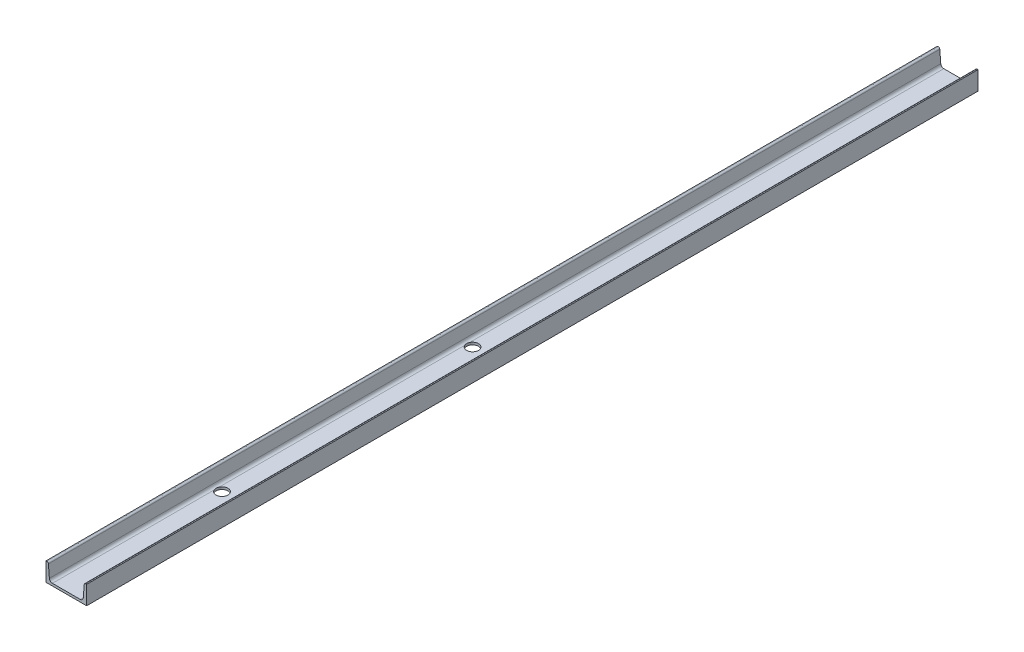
ISO-10303-21;
HEADER;
FILE_DESCRIPTION(('STEP AP214'),'2;1');
FILE_NAME('part.step','',(''),(''),'','','');
FILE_SCHEMA(('AUTOMOTIVE_DESIGN { 1 0 10303 214 1 1 1 1 }'));
ENDSEC;
DATA;
#1=APPLICATION_CONTEXT('core data for automotive mechanical design processes');
#2=APPLICATION_PROTOCOL_DEFINITION('international standard','automotive_design',2000,#1);
#3=PRODUCT_CONTEXT('',#1,'mechanical');
#4=PRODUCT('Part','Part','',(#3));
#5=PRODUCT_RELATED_PRODUCT_CATEGORY('part','',(#4));
#6=PRODUCT_DEFINITION_FORMATION('','',#4);
#7=PRODUCT_DEFINITION_CONTEXT('part definition',#1,'design');
#8=PRODUCT_DEFINITION('design','',#6,#7);
#9=PRODUCT_DEFINITION_SHAPE('','',#8);
#10=(LENGTH_UNIT() NAMED_UNIT(*) SI_UNIT(.MILLI.,.METRE.));
#11=(NAMED_UNIT(*) PLANE_ANGLE_UNIT() SI_UNIT($,.RADIAN.));
#12=(NAMED_UNIT(*) SI_UNIT($,.STERADIAN.) SOLID_ANGLE_UNIT());
#13=UNCERTAINTY_MEASURE_WITH_UNIT(LENGTH_MEASURE(1.E-05),#10,'distance_accuracy_value','');
#14=(GEOMETRIC_REPRESENTATION_CONTEXT(3) GLOBAL_UNCERTAINTY_ASSIGNED_CONTEXT((#13)) GLOBAL_UNIT_ASSIGNED_CONTEXT((#10,
#11,#12)) REPRESENTATION_CONTEXT('',''));
#15=CARTESIAN_POINT('',(0.,0.,0.));
#16=DIRECTION('',(0.,0.,1.));
#17=DIRECTION('',(1.,0.,0.));
#18=AXIS2_PLACEMENT_3D('',#15,#16,#17);
#19=CARTESIAN_POINT('',(41.0512459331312,16.,-1316.5));
#20=DIRECTION('',(0.,0.,1.));
#21=DIRECTION('',(1.,0.,0.));
#22=AXIS2_PLACEMENT_3D('',#19,#20,#21);
#23=CYLINDRICAL_SURFACE('',#22,8.99999999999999);
#24=CARTESIAN_POINT('',(41.0512459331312,16.,1316.5));
#25=DIRECTION('',(0.,0.,-1.));
#26=DIRECTION('',(-1.,0.,0.));
#27=AXIS2_PLACEMENT_3D('',#24,#25,#26);
#28=CIRCLE('',#27,8.99999999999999);
#29=CARTESIAN_POINT('',(50.0225834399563,15.282292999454,1316.5));
#30=VERTEX_POINT('',#29);
#31=CARTESIAN_POINT('',(41.0512459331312,7.,1316.5));
#32=VERTEX_POINT('',#31);
#33=EDGE_CURVE('E266',#30,#32,#28,.T.);
#34=ORIENTED_EDGE('',*,*,#33,.F.);
#35=DIRECTION('',(0.,0.,1.));
#36=VECTOR('',#35,1.);
#37=CARTESIAN_POINT('',(50.0225834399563,15.282292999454,-1316.5));
#38=LINE('',#37,#36);
#39=CARTESIAN_POINT('',(50.0225834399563,15.282292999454,-1316.5));
#40=VERTEX_POINT('',#39);
#41=EDGE_CURVE('E165',#40,#30,#38,.T.);
#42=ORIENTED_EDGE('',*,*,#41,.F.);
#43=CARTESIAN_POINT('',(41.0512459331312,16.,-1316.5));
#44=DIRECTION('',(0.,0.,-1.));
#45=DIRECTION('',(-1.,0.,0.));
#46=AXIS2_PLACEMENT_3D('',#43,#44,#45);
#47=CIRCLE('',#46,8.99999999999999);
#48=CARTESIAN_POINT('',(41.0512459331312,7.,-1316.5));
#49=VERTEX_POINT('',#48);
#50=EDGE_CURVE('E233',#40,#49,#47,.T.);
#51=ORIENTED_EDGE('',*,*,#50,.T.);
#52=DIRECTION('',(0.,0.,1.));
#53=VECTOR('',#52,1.);
#54=CARTESIAN_POINT('',(41.0512459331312,7.,-1316.5));
#55=LINE('',#54,#53);
#56=EDGE_CURVE('E154',#49,#32,#55,.T.);
#57=ORIENTED_EDGE('',*,*,#56,.T.);
#58=EDGE_LOOP('',(#34,#42,#51,#57));
#59=FACE_BOUND('',#58,.T.);
#60=ADVANCED_FACE('F33',(#59),#23,.F.);
#61=CARTESIAN_POINT('',(52.8687082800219,50.858853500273,-1316.5));
#62=DIRECTION('',(-0.996815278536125,0.0797452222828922,0.));
#63=DIRECTION('',(-0.0797452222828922,-0.996815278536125,0.));
#64=AXIS2_PLACEMENT_3D('',#61,#62,#63);
#65=PLANE('',#64);
#66=DIRECTION('',(-0.0797452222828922,-0.996815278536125,0.));
#67=VECTOR('',#66,1.);
#68=CARTESIAN_POINT('',(52.8687082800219,50.858853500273,1316.5));
#69=LINE('',#68,#67);
#70=CARTESIAN_POINT('',(52.8687082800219,50.858853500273,1316.5));
#71=VERTEX_POINT('',#70);
#72=EDGE_CURVE('E173',#71,#30,#69,.T.);
#73=ORIENTED_EDGE('',*,*,#72,.F.);
#74=DIRECTION('',(0.,0.,1.));
#75=VECTOR('',#74,1.);
#76=CARTESIAN_POINT('',(52.8687082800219,50.858853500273,-1316.5));
#77=LINE('',#76,#75);
#78=CARTESIAN_POINT('',(52.8687082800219,50.858853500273,-1316.5));
#79=VERTEX_POINT('',#78);
#80=EDGE_CURVE('E166',#79,#71,#77,.T.);
#81=ORIENTED_EDGE('',*,*,#80,.F.);
#82=DIRECTION('',(-0.0797452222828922,-0.996815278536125,0.));
#83=VECTOR('',#82,1.);
#84=CARTESIAN_POINT('',(52.8687082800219,50.858853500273,-1316.5));
#85=LINE('',#84,#83);
#86=EDGE_CURVE('E158',#79,#40,#85,.T.);
#87=ORIENTED_EDGE('',*,*,#86,.T.);
#88=ORIENTED_EDGE('',*,*,#41,.T.);
#89=EDGE_LOOP('',(#73,#81,#87,#88));
#90=FACE_BOUND('',#89,.T.);
#91=ADVANCED_FACE('F289',(#90),#65,.T.);
#92=CARTESIAN_POINT('',(57.3543770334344,50.5,-1316.5));
#93=DIRECTION('',(0.,0.,1.));
#94=DIRECTION('',(1.,0.,0.));
#95=AXIS2_PLACEMENT_3D('',#92,#93,#94);
#96=CYLINDRICAL_SURFACE('',#95,4.49999999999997);
#97=CARTESIAN_POINT('',(57.3543770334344,50.5,1316.5));
#98=DIRECTION('',(0.,0.,1.));
#99=DIRECTION('',(1.,0.,0.));
#100=AXIS2_PLACEMENT_3D('',#97,#98,#99);
#101=CIRCLE('',#100,4.49999999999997);
#102=CARTESIAN_POINT('',(57.3543770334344,55.,1316.5));
#103=VERTEX_POINT('',#102);
#104=EDGE_CURVE('E229',#103,#71,#101,.T.);
#105=ORIENTED_EDGE('',*,*,#104,.F.);
#106=DIRECTION('',(0.,0.,1.));
#107=VECTOR('',#106,1.);
#108=CARTESIAN_POINT('',(57.3543770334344,55.,-1316.5));
#109=LINE('',#108,#107);
#110=CARTESIAN_POINT('',(57.3543770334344,55.,-1316.5));
#111=VERTEX_POINT('',#110);
#112=EDGE_CURVE('E170',#111,#103,#109,.T.);
#113=ORIENTED_EDGE('',*,*,#112,.F.);
#114=CARTESIAN_POINT('',(57.3543770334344,50.5,-1316.5));
#115=DIRECTION('',(0.,0.,1.));
#116=DIRECTION('',(1.,0.,0.));
#117=AXIS2_PLACEMENT_3D('',#114,#115,#116);
#118=CIRCLE('',#117,4.49999999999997);
#119=EDGE_CURVE('E163',#111,#79,#118,.T.);
#120=ORIENTED_EDGE('',*,*,#119,.T.);
#121=ORIENTED_EDGE('',*,*,#80,.T.);
#122=EDGE_LOOP('',(#105,#113,#120,#121));
#123=FACE_BOUND('',#122,.T.);
#124=ADVANCED_FACE('F292',(#123),#96,.T.);
#125=CARTESIAN_POINT('',(60.,55.,-1316.5));
#126=DIRECTION('',(0.,1.,0.));
#127=DIRECTION('',(0.,0.,1.));
#128=AXIS2_PLACEMENT_3D('',#125,#126,#127);
#129=PLANE('',#128);
#130=DIRECTION('',(-1.,0.,0.));
#131=VECTOR('',#130,1.);
#132=CARTESIAN_POINT('',(60.,55.,1316.5));
#133=LINE('',#132,#131);
#134=CARTESIAN_POINT('',(60.,55.,1316.5));
#135=VERTEX_POINT('',#134);
#136=EDGE_CURVE('E227',#135,#103,#133,.T.);
#137=ORIENTED_EDGE('',*,*,#136,.F.);
#138=DIRECTION('',(0.,0.,1.));
#139=VECTOR('',#138,1.);
#140=CARTESIAN_POINT('',(60.,55.,-1316.5));
#141=LINE('',#140,#139);
#142=CARTESIAN_POINT('',(60.,55.,-1316.5));
#143=VERTEX_POINT('',#142);
#144=EDGE_CURVE('E177',#143,#135,#141,.T.);
#145=ORIENTED_EDGE('',*,*,#144,.F.);
#146=DIRECTION('',(-1.,0.,0.));
#147=VECTOR('',#146,1.);
#148=CARTESIAN_POINT('',(60.,55.,-1316.5));
#149=LINE('',#148,#147);
#150=EDGE_CURVE('E261',#143,#111,#149,.T.);
#151=ORIENTED_EDGE('',*,*,#150,.T.);
#152=ORIENTED_EDGE('',*,*,#112,.T.);
#153=EDGE_LOOP('',(#137,#145,#151,#152));
#154=FACE_BOUND('',#153,.T.);
#155=ADVANCED_FACE('F295',(#154),#129,.T.);
#156=CARTESIAN_POINT('',(60.,0.,-1316.5));
#157=DIRECTION('',(1.,0.,0.));
#158=DIRECTION('',(0.,0.,-1.));
#159=AXIS2_PLACEMENT_3D('',#156,#157,#158);
#160=PLANE('',#159);
#161=DIRECTION('',(0.,1.,0.));
#162=VECTOR('',#161,1.);
#163=CARTESIAN_POINT('',(60.,0.,1316.5));
#164=LINE('',#163,#162);
#165=CARTESIAN_POINT('',(60.,0.,1316.5));
#166=VERTEX_POINT('',#165);
#167=EDGE_CURVE('E224',#166,#135,#164,.T.);
#168=ORIENTED_EDGE('',*,*,#167,.F.);
#169=DIRECTION('',(0.,0.,1.));
#170=VECTOR('',#169,1.);
#171=CARTESIAN_POINT('',(60.,0.,-1316.5));
#172=LINE('',#171,#170);
#173=CARTESIAN_POINT('',(60.,0.,-1316.5));
#174=VERTEX_POINT('',#173);
#175=EDGE_CURVE('E179',#174,#166,#172,.T.);
#176=ORIENTED_EDGE('',*,*,#175,.F.);
#177=DIRECTION('',(0.,1.,0.));
#178=VECTOR('',#177,1.);
#179=CARTESIAN_POINT('',(60.,0.,-1316.5));
#180=LINE('',#179,#178);
#181=EDGE_CURVE('E258',#174,#143,#180,.T.);
#182=ORIENTED_EDGE('',*,*,#181,.T.);
#183=ORIENTED_EDGE('',*,*,#144,.T.);
#184=EDGE_LOOP('',(#168,#176,#182,#183));
#185=FACE_BOUND('',#184,.T.);
#186=ADVANCED_FACE('F299',(#185),#160,.T.);
#187=CARTESIAN_POINT('',(-60.,0.,-1316.5));
#188=DIRECTION('',(0.,-1.,0.));
#189=DIRECTION('',(0.,0.,-1.));
#190=AXIS2_PLACEMENT_3D('',#187,#188,#189);
#191=PLANE('',#190);
#192=CARTESIAN_POINT('',(-25.,0.,91.5000000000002));
#193=DIRECTION('',(0.,1.,0.));
#194=DIRECTION('',(0.,0.,1.));
#195=AXIS2_PLACEMENT_3D('',#192,#193,#194);
#196=CIRCLE('',#195,17.5);
#197=CARTESIAN_POINT('',(-25.,0.,109.));
#198=VERTEX_POINT('',#197);
#199=EDGE_CURVE('E142',#198,#198,#196,.T.);
#200=ORIENTED_EDGE('',*,*,#199,.T.);
#201=EDGE_LOOP('',(#200));
#202=FACE_BOUND('',#201,.T.);
#203=CARTESIAN_POINT('',(-25.,0.,831.5));
#204=DIRECTION('',(0.,1.,0.));
#205=DIRECTION('',(0.,0.,1.));
#206=AXIS2_PLACEMENT_3D('',#203,#204,#205);
#207=CIRCLE('',#206,17.5);
#208=CARTESIAN_POINT('',(-25.,0.,849.));
#209=VERTEX_POINT('',#208);
#210=EDGE_CURVE('E141',#209,#209,#207,.T.);
#211=ORIENTED_EDGE('',*,*,#210,.T.);
#212=EDGE_LOOP('',(#211));
#213=FACE_BOUND('',#212,.T.);
#214=DIRECTION('',(1.,0.,0.));
#215=VECTOR('',#214,1.);
#216=CARTESIAN_POINT('',(-60.,0.,1316.5));
#217=LINE('',#216,#215);
#218=CARTESIAN_POINT('',(-60.,0.,1316.5));
#219=VERTEX_POINT('',#218);
#220=EDGE_CURVE('E221',#219,#166,#217,.T.);
#221=ORIENTED_EDGE('',*,*,#220,.F.);
#222=DIRECTION('',(0.,0.,1.));
#223=VECTOR('',#222,1.);
#224=CARTESIAN_POINT('',(-60.,0.,-1316.5));
#225=LINE('',#224,#223);
#226=CARTESIAN_POINT('',(-60.,0.,-1316.5));
#227=VERTEX_POINT('',#226);
#228=EDGE_CURVE('E181',#227,#219,#225,.T.);
#229=ORIENTED_EDGE('',*,*,#228,.F.);
#230=DIRECTION('',(1.,0.,0.));
#231=VECTOR('',#230,1.);
#232=CARTESIAN_POINT('',(-60.,0.,-1316.5));
#233=LINE('',#232,#231);
#234=EDGE_CURVE('E255',#227,#174,#233,.T.);
#235=ORIENTED_EDGE('',*,*,#234,.T.);
#236=ORIENTED_EDGE('',*,*,#175,.T.);
#237=EDGE_LOOP('',(#221,#229,#235,#236));
#238=FACE_BOUND('',#237,.T.);
#239=ADVANCED_FACE('F303',(#202,#213,#238),#191,.T.);
#240=CARTESIAN_POINT('',(-60.,55.,-1316.5));
#241=DIRECTION('',(-1.,0.,0.));
#242=DIRECTION('',(0.,0.,1.));
#243=AXIS2_PLACEMENT_3D('',#240,#241,#242);
#244=PLANE('',#243);
#245=DIRECTION('',(0.,-1.,0.));
#246=VECTOR('',#245,1.);
#247=CARTESIAN_POINT('',(-60.,55.,1316.5));
#248=LINE('',#247,#246);
#249=CARTESIAN_POINT('',(-60.,55.,1316.5));
#250=VERTEX_POINT('',#249);
#251=EDGE_CURVE('E218',#250,#219,#248,.T.);
#252=ORIENTED_EDGE('',*,*,#251,.F.);
#253=DIRECTION('',(0.,0.,1.));
#254=VECTOR('',#253,1.);
#255=CARTESIAN_POINT('',(-60.,55.,-1316.5));
#256=LINE('',#255,#254);
#257=CARTESIAN_POINT('',(-60.,55.,-1316.5));
#258=VERTEX_POINT('',#257);
#259=EDGE_CURVE('E183',#258,#250,#256,.T.);
#260=ORIENTED_EDGE('',*,*,#259,.F.);
#261=DIRECTION('',(0.,-1.,0.));
#262=VECTOR('',#261,1.);
#263=CARTESIAN_POINT('',(-60.,55.,-1316.5));
#264=LINE('',#263,#262);
#265=EDGE_CURVE('E252',#258,#227,#264,.T.);
#266=ORIENTED_EDGE('',*,*,#265,.T.);
#267=ORIENTED_EDGE('',*,*,#228,.T.);
#268=EDGE_LOOP('',(#252,#260,#266,#267));
#269=FACE_BOUND('',#268,.T.);
#270=ADVANCED_FACE('F307',(#269),#244,.T.);
#271=CARTESIAN_POINT('',(-57.3543770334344,55.,-1316.5));
#272=DIRECTION('',(0.,1.,0.));
#273=DIRECTION('',(0.,0.,1.));
#274=AXIS2_PLACEMENT_3D('',#271,#272,#273);
#275=PLANE('',#274);
#276=DIRECTION('',(-1.,0.,0.));
#277=VECTOR('',#276,1.);
#278=CARTESIAN_POINT('',(-57.3543770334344,55.,1316.5));
#279=LINE('',#278,#277);
#280=CARTESIAN_POINT('',(-57.3543770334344,55.,1316.5));
#281=VERTEX_POINT('',#280);
#282=EDGE_CURVE('E206',#281,#250,#279,.T.);
#283=ORIENTED_EDGE('',*,*,#282,.F.);
#284=DIRECTION('',(0.,0.,1.));
#285=VECTOR('',#284,1.);
#286=CARTESIAN_POINT('',(-57.3543770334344,55.,-1316.5));
#287=LINE('',#286,#285);
#288=CARTESIAN_POINT('',(-57.3543770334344,55.,-1316.5));
#289=VERTEX_POINT('',#288);
#290=EDGE_CURVE('E185',#289,#281,#287,.T.);
#291=ORIENTED_EDGE('',*,*,#290,.F.);
#292=DIRECTION('',(-1.,0.,0.));
#293=VECTOR('',#292,1.);
#294=CARTESIAN_POINT('',(-57.3543770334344,55.,-1316.5));
#295=LINE('',#294,#293);
#296=EDGE_CURVE('E249',#289,#258,#295,.T.);
#297=ORIENTED_EDGE('',*,*,#296,.T.);
#298=ORIENTED_EDGE('',*,*,#259,.T.);
#299=EDGE_LOOP('',(#283,#291,#297,#298));
#300=FACE_BOUND('',#299,.T.);
#301=ADVANCED_FACE('F311',(#300),#275,.T.);
#302=CARTESIAN_POINT('',(-57.3543770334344,50.5,-1316.5));
#303=DIRECTION('',(0.,0.,1.));
#304=DIRECTION('',(1.,0.,0.));
#305=AXIS2_PLACEMENT_3D('',#302,#303,#304);
#306=CYLINDRICAL_SURFACE('',#305,4.50000000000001);
#307=CARTESIAN_POINT('',(-57.3543770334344,50.5,1316.5));
#308=DIRECTION('',(0.,0.,1.));
#309=DIRECTION('',(1.,0.,0.));
#310=AXIS2_PLACEMENT_3D('',#307,#308,#309);
#311=CIRCLE('',#310,4.50000000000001);
#312=CARTESIAN_POINT('',(-52.8687082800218,50.858853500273,1316.5));
#313=VERTEX_POINT('',#312);
#314=EDGE_CURVE('E201',#313,#281,#311,.T.);
#315=ORIENTED_EDGE('',*,*,#314,.F.);
#316=DIRECTION('',(0.,0.,1.));
#317=VECTOR('',#316,1.);
#318=CARTESIAN_POINT('',(-52.8687082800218,50.858853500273,-1316.5));
#319=LINE('',#318,#317);
#320=CARTESIAN_POINT('',(-52.8687082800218,50.858853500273,-1316.5));
#321=VERTEX_POINT('',#320);
#322=EDGE_CURVE('E151',#321,#313,#319,.T.);
#323=ORIENTED_EDGE('',*,*,#322,.F.);
#324=CARTESIAN_POINT('',(-57.3543770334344,50.5,-1316.5));
#325=DIRECTION('',(0.,0.,1.));
#326=DIRECTION('',(1.,0.,0.));
#327=AXIS2_PLACEMENT_3D('',#324,#325,#326);
#328=CIRCLE('',#327,4.50000000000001);
#329=EDGE_CURVE('E247',#321,#289,#328,.T.);
#330=ORIENTED_EDGE('',*,*,#329,.T.);
#331=ORIENTED_EDGE('',*,*,#290,.T.);
#332=EDGE_LOOP('',(#315,#323,#330,#331));
#333=FACE_BOUND('',#332,.T.);
#334=ADVANCED_FACE('F202',(#333),#306,.T.);
#335=CARTESIAN_POINT('',(-50.0225834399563,15.282292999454,-1316.5));
#336=DIRECTION('',(0.996815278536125,0.0797452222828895,0.));
#337=DIRECTION('',(-0.0797452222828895,0.996815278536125,0.));
#338=AXIS2_PLACEMENT_3D('',#335,#336,#337);
#339=PLANE('',#338);
#340=DIRECTION('',(-0.0797452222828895,0.996815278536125,0.));
#341=VECTOR('',#340,1.);
#342=CARTESIAN_POINT('',(-50.0225834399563,15.282292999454,1316.5));
#343=LINE('',#342,#341);
#344=CARTESIAN_POINT('',(-50.0225834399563,15.282292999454,1316.5));
#345=VERTEX_POINT('',#344);
#346=EDGE_CURVE('E193',#345,#313,#343,.T.);
#347=ORIENTED_EDGE('',*,*,#346,.F.);
#348=DIRECTION('',(0.,0.,1.));
#349=VECTOR('',#348,1.);
#350=CARTESIAN_POINT('',(-50.0225834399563,15.282292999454,-1316.5));
#351=LINE('',#350,#349);
#352=CARTESIAN_POINT('',(-50.0225834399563,15.282292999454,-1316.5));
#353=VERTEX_POINT('',#352);
#354=EDGE_CURVE('E148',#353,#345,#351,.T.);
#355=ORIENTED_EDGE('',*,*,#354,.F.);
#356=DIRECTION('',(-0.0797452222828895,0.996815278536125,0.));
#357=VECTOR('',#356,1.);
#358=CARTESIAN_POINT('',(-50.0225834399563,15.282292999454,-1316.5));
#359=LINE('',#358,#357);
#360=EDGE_CURVE('E196',#353,#321,#359,.T.);
#361=ORIENTED_EDGE('',*,*,#360,.T.);
#362=ORIENTED_EDGE('',*,*,#322,.T.);
#363=EDGE_LOOP('',(#347,#355,#361,#362));
#364=FACE_BOUND('',#363,.T.);
#365=ADVANCED_FACE('F191',(#364),#339,.T.);
#366=CARTESIAN_POINT('',(-41.0512459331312,16.,-1316.5));
#367=DIRECTION('',(0.,0.,1.));
#368=DIRECTION('',(1.,0.,0.));
#369=AXIS2_PLACEMENT_3D('',#366,#367,#368);
#370=CYLINDRICAL_SURFACE('',#369,8.99999999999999);
#371=CARTESIAN_POINT('',(-32.0512459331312,16.,75.4834482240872));
#372=CARTESIAN_POINT('',(-32.0512386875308,15.7692457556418,75.4834508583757));
#373=CARTESIAN_POINT('',(-32.0601229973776,15.5385666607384,75.4873490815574));
#374=CARTESIAN_POINT('',(-32.0955516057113,15.0787728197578,75.5030136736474));
#375=CARTESIAN_POINT('',(-32.1220977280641,14.8496582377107,75.5147808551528));
#376=CARTESIAN_POINT('',(-32.1925939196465,14.3945907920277,75.5463775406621));
#377=CARTESIAN_POINT('',(-32.2365516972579,14.1686393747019,75.5662106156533));
#378=CARTESIAN_POINT('',(-32.3413883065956,13.721606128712,75.6142409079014));
#379=CARTESIAN_POINT('',(-32.4022666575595,13.5005241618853,75.642437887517));
#380=CARTESIAN_POINT('',(-32.5402713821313,13.0647739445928,75.7075928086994));
#381=CARTESIAN_POINT('',(-32.6174005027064,12.8501067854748,75.744552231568));
#382=CARTESIAN_POINT('',(-32.7869962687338,12.4287608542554,75.8276804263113));
#383=CARTESIAN_POINT('',(-32.8794629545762,12.2220821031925,75.873849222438));
#384=CARTESIAN_POINT('',(-33.0785725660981,11.818236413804,75.9758521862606));
#385=CARTESIAN_POINT('',(-33.1852111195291,11.621066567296,76.0316833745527));
#386=CARTESIAN_POINT('',(-33.4113306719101,11.2375160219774,76.15346954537));
#387=CARTESIAN_POINT('',(-33.5308115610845,11.0511352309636,76.2194244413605));
#388=CARTESIAN_POINT('',(-33.7804890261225,10.691152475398,76.3615211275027));
#389=CARTESIAN_POINT('',(-33.9106353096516,10.5174971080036,76.4376160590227));
#390=CARTESIAN_POINT('',(-34.180375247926,10.1830165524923,76.600485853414));
#391=CARTESIAN_POINT('',(-34.3199688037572,10.0221912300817,76.687260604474));
#392=CARTESIAN_POINT('',(-34.6067393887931,9.71409299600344,76.8716165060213));
#393=CARTESIAN_POINT('',(-34.7539160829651,9.56681948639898,76.9691971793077));
#394=CARTESIAN_POINT('',(-35.0539306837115,9.28625304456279,77.1751412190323));
#395=CARTESIAN_POINT('',(-35.2067687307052,9.15296045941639,77.2835048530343));
#396=CARTESIAN_POINT('',(-35.520426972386,8.89703353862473,77.5139529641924));
#397=CARTESIAN_POINT('',(-35.6813510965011,8.7747929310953,77.636332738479));
#398=CARTESIAN_POINT('',(-36.0051058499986,8.5450770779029,77.8919074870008));
#399=CARTESIAN_POINT('',(-36.1679364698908,8.43760175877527,78.0251024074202));
#400=CARTESIAN_POINT('',(-36.4936634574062,8.23694361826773,78.3018421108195));
#401=CARTESIAN_POINT('',(-36.6565598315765,8.14376402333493,78.4453892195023));
#402=CARTESIAN_POINT('',(-36.9807118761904,7.97102122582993,78.7422225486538));
#403=CARTESIAN_POINT('',(-37.1419671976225,7.89146086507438,78.8955107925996));
#404=CARTESIAN_POINT('',(-37.5283399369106,7.71439225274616,79.2773924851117));
#405=CARTESIAN_POINT('',(-37.7518784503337,7.62334997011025,79.5106072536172));
#406=CARTESIAN_POINT('',(-38.1891813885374,7.46402884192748,79.9934055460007));
#407=CARTESIAN_POINT('',(-38.4029423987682,7.39575789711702,80.2429947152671));
#408=CARTESIAN_POINT('',(-38.8184632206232,7.27868302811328,80.7571171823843));
#409=CARTESIAN_POINT('',(-39.0201982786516,7.22991815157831,81.0216792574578));
#410=CARTESIAN_POINT('',(-39.4092875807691,7.14881552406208,81.5635140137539));
#411=CARTESIAN_POINT('',(-39.5966413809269,7.11647828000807,81.8407870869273));
#412=CARTESIAN_POINT('',(-40.0193071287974,7.05597919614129,82.5068766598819));
#413=CARTESIAN_POINT('',(-40.248059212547,7.03336654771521,82.9003740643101));
#414=CARTESIAN_POINT('',(-40.6744266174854,7.00535326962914,83.7045086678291));
#415=CARTESIAN_POINT('',(-40.8720309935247,6.99995867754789,84.1151518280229));
#416=CARTESIAN_POINT('',(-41.2347045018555,7.00004182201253,84.950805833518));
#417=CARTESIAN_POINT('',(-41.3997548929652,7.00552580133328,85.3758247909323));
#418=CARTESIAN_POINT('',(-41.696147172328,7.02190798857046,86.2372850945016));
#419=CARTESIAN_POINT('',(-41.8274922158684,7.03280568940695,86.6737253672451));
#420=CARTESIAN_POINT('',(-42.0580762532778,7.05572747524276,87.5645204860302));
#421=CARTESIAN_POINT('',(-42.1566037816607,7.06777003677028,88.0190591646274));
#422=CARTESIAN_POINT('',(-42.3171811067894,7.08910889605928,88.934606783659));
#423=CARTESIAN_POINT('',(-42.3792305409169,7.09840516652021,89.3956157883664));
#424=CARTESIAN_POINT('',(-42.4664145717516,7.11184749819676,90.3209383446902));
#425=CARTESIAN_POINT('',(-42.4915694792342,7.11599639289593,90.785249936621));
#426=CARTESIAN_POINT('',(-42.5048541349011,7.11816112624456,91.7144159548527));
#427=CARTESIAN_POINT('',(-42.4929835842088,7.11617691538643,92.1792703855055));
#428=CARTESIAN_POINT('',(-42.4307298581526,7.10628912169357,93.1304510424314));
#429=CARTESIAN_POINT('',(-42.378390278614,7.09808526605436,93.6166469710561));
#430=CARTESIAN_POINT('',(-42.2332342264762,7.0776544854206,94.5829154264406));
#431=CARTESIAN_POINT('',(-42.1404131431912,7.06542710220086,95.0629872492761));
#432=CARTESIAN_POINT('',(-41.9148576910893,7.04081269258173,96.0140498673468));
#433=CARTESIAN_POINT('',(-41.7820919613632,7.02842554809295,96.4850332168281));
#434=CARTESIAN_POINT('',(-41.4775658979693,7.00880832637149,97.4142859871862));
#435=CARTESIAN_POINT('',(-41.3058128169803,7.0015772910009,97.8725577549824));
#436=CARTESIAN_POINT('',(-40.9586580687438,6.99911848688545,98.6925280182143));
#437=CARTESIAN_POINT('',(-40.7894082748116,7.00197445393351,99.0568341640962));
#438=CARTESIAN_POINT('',(-40.4263550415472,7.01988013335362,99.7727621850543));
#439=CARTESIAN_POINT('',(-40.2325515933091,7.03492985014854,100.12438405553));
#440=CARTESIAN_POINT('',(-39.8221275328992,7.08193666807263,100.812066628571));
#441=CARTESIAN_POINT('',(-39.6055488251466,7.11386313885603,101.148154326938));
#442=CARTESIAN_POINT('',(-39.1513369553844,7.19978845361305,101.80282360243));
#443=CARTESIAN_POINT('',(-38.9137113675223,7.25377938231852,102.121411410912));
#444=CARTESIAN_POINT('',(-38.4884169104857,7.37061827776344,102.653232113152));
#445=CARTESIAN_POINT('',(-38.3050067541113,7.42693490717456,102.871321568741));
#446=CARTESIAN_POINT('',(-37.9303844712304,7.55609914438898,103.295556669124));
#447=CARTESIAN_POINT('',(-37.7391743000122,7.62894262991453,103.501705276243));
#448=CARTESIAN_POINT('',(-37.351162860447,7.79306936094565,103.900650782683));
#449=CARTESIAN_POINT('',(-37.1543667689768,7.88433598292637,104.093459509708));
#450=CARTESIAN_POINT('',(-36.7575972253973,8.08708787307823,104.464669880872));
#451=CARTESIAN_POINT('',(-36.5576242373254,8.19857021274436,104.643073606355));
#452=CARTESIAN_POINT('',(-36.1877068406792,8.42466859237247,104.958645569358));
#453=CARTESIAN_POINT('',(-36.0177737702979,8.53628644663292,105.097978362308));
#454=CARTESIAN_POINT('',(-35.679984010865,8.77557178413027,105.364856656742));
#455=CARTESIAN_POINT('',(-35.5121269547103,8.90323638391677,105.492404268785));
#456=CARTESIAN_POINT('',(-35.1807797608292,9.17478937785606,105.735305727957));
#457=CARTESIAN_POINT('',(-35.0172892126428,9.31867624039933,105.850660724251));
#458=CARTESIAN_POINT('',(-34.6970368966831,9.62248195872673,106.068975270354));
#459=CARTESIAN_POINT('',(-34.5402752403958,9.78240107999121,106.17193461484));
#460=CARTESIAN_POINT('',(-34.2353187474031,10.118268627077,106.365788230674));
#461=CARTESIAN_POINT('',(-34.0871559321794,10.2942713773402,106.456638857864));
#462=CARTESIAN_POINT('',(-33.8022777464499,10.6608666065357,106.62604989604));
#463=CARTESIAN_POINT('',(-33.6655625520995,10.8514593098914,106.704610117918));
#464=CARTESIAN_POINT('',(-33.4056559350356,11.2459743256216,106.849824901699));
#465=CARTESIAN_POINT('',(-33.2824660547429,11.44989815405,106.916478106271));
#466=CARTESIAN_POINT('',(-33.0514650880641,11.8695204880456,107.038371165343));
#467=CARTESIAN_POINT('',(-32.9436532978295,12.0852184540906,107.093611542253));
#468=CARTESIAN_POINT('',(-32.7513242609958,12.512503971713,107.190053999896));
#469=CARTESIAN_POINT('',(-32.6657565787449,12.7234681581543,107.231929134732));
#470=CARTESIAN_POINT('',(-32.5104661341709,13.152692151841,107.306654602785));
#471=CARTESIAN_POINT('',(-32.440742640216,13.3709516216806,107.339505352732));
#472=CARTESIAN_POINT('',(-32.3179471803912,13.8131859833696,107.396610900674));
#473=CARTESIAN_POINT('',(-32.2648741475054,14.0371605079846,107.420866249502));
#474=CARTESIAN_POINT('',(-32.1759622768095,14.4892351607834,107.461138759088));
#475=CARTESIAN_POINT('',(-32.1401236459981,14.7173353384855,107.477155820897));
#476=CARTESIAN_POINT('',(-32.086161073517,15.1752447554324,107.501162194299));
#477=CARTESIAN_POINT('',(-32.0679769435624,15.4050454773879,107.509178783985));
#478=CARTESIAN_POINT('',(-32.0493015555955,15.865502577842,107.517410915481));
#479=CARTESIAN_POINT('',(-32.048810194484,16.0961589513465,107.517626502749));
#480=CARTESIAN_POINT('',(-32.0655255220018,16.5567103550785,107.510260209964));
#481=CARTESIAN_POINT('',(-32.0827326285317,16.7866053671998,107.50267814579));
#482=CARTESIAN_POINT('',(-32.1346646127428,17.244007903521,107.479592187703));
#483=CARTESIAN_POINT('',(-32.16938954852,17.4715154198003,107.464088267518));
#484=CARTESIAN_POINT('',(-32.2561775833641,17.9235299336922,107.424828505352));
#485=CARTESIAN_POINT('',(-32.3083167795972,18.1480191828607,107.401036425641));
#486=CARTESIAN_POINT('',(-32.4293140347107,18.5913479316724,107.344864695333));
#487=CARTESIAN_POINT('',(-32.4981721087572,18.8101874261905,107.312485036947));
#488=CARTESIAN_POINT('',(-32.6518016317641,19.2406083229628,107.23871613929));
#489=CARTESIAN_POINT('',(-32.7365708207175,19.4521907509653,107.197328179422));
#490=CARTESIAN_POINT('',(-32.9210093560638,19.866612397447,107.105070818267));
#491=CARTESIAN_POINT('',(-33.020678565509,20.0694516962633,107.054201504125));
#492=CARTESIAN_POINT('',(-33.233063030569,20.4638428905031,106.942828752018));
#493=CARTESIAN_POINT('',(-33.3457009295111,20.6554523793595,106.882381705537));
#494=CARTESIAN_POINT('',(-33.5830260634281,21.0273602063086,106.751230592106));
#495=CARTESIAN_POINT('',(-33.7077131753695,21.2076586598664,106.680526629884));
#496=CARTESIAN_POINT('',(-33.9674718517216,21.5558360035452,106.528542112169));
#497=CARTESIAN_POINT('',(-34.1025417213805,21.7237169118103,106.447263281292));
#498=CARTESIAN_POINT('',(-34.3812802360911,22.0462376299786,106.273913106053));
#499=CARTESIAN_POINT('',(-34.5249489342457,22.2008773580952,106.181841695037));
#500=CARTESIAN_POINT('',(-34.8200572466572,22.4974123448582,105.986132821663));
#501=CARTESIAN_POINT('',(-34.9715462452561,22.6392054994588,105.882415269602));
#502=CARTESIAN_POINT('',(-35.2793184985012,22.908448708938,105.664081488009));
#503=CARTESIAN_POINT('',(-35.4356017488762,23.0358987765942,105.549465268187));
#504=CARTESIAN_POINT('',(-35.7510157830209,23.2764625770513,105.309594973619));
#505=CARTESIAN_POINT('',(-35.9101467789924,23.3895752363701,105.184340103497));
#506=CARTESIAN_POINT('',(-36.2294032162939,23.6017485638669,104.923598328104));
#507=CARTESIAN_POINT('',(-36.3895287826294,23.7008074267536,104.78811011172));
#508=CARTESIAN_POINT('',(-36.7221804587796,23.8929752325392,104.495900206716));
#509=CARTESIAN_POINT('',(-36.8946449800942,23.9849274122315,104.338348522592));
#510=CARTESIAN_POINT('',(-37.236810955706,24.1539258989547,104.012644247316));
#511=CARTESIAN_POINT('',(-37.4065123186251,24.230971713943,103.84449130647));
#512=CARTESIAN_POINT('',(-37.7416131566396,24.3713410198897,103.498306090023));
#513=CARTESIAN_POINT('',(-37.9070104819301,24.434657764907,103.320269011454));
#514=CARTESIAN_POINT('',(-38.2320970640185,24.5488061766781,102.95519138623));
#515=CARTESIAN_POINT('',(-38.391785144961,24.5996352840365,102.768149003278));
#516=CARTESIAN_POINT('',(-38.7945374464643,24.7162565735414,102.275535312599));
#517=CARTESIAN_POINT('',(-39.0325546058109,24.7737641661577,101.963835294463));
#518=CARTESIAN_POINT('',(-39.4884928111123,24.8663394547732,101.322856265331));
#519=CARTESIAN_POINT('',(-39.706404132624,24.9013963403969,100.99356886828));
#520=CARTESIAN_POINT('',(-40.1203534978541,24.9541639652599,100.319391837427));
#521=CARTESIAN_POINT('',(-40.316349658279,24.9718419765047,99.9744740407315));
#522=CARTESIAN_POINT('',(-40.6845581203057,24.9944184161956,99.2718706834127));
#523=CARTESIAN_POINT('',(-40.8567729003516,24.9993181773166,98.9141864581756));
#524=CARTESIAN_POINT('',(-41.1812888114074,25.0005671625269,98.177042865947));
#525=CARTESIAN_POINT('',(-41.3328368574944,24.996655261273,97.7972521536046));
#526=CARTESIAN_POINT('',(-41.6089513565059,24.983766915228,97.0280845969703));
#527=CARTESIAN_POINT('',(-41.733517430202,24.9747903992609,96.6387076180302));
#528=CARTESIAN_POINT('',(-41.9550088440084,24.955198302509,95.8525092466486));
#529=CARTESIAN_POINT('',(-42.0519538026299,24.9445838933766,95.4556933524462));
#530=CARTESIAN_POINT('',(-42.217870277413,24.9244583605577,94.6562091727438));
#531=CARTESIAN_POINT('',(-42.2868395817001,24.9149473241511,94.2535404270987));
#532=CARTESIAN_POINT('',(-42.407301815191,24.8975064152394,93.3641495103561));
#533=CARTESIAN_POINT('',(-42.4526338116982,24.8902620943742,92.8765654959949));
#534=CARTESIAN_POINT('',(-42.5022883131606,24.8822909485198,91.899221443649));
#535=CARTESIAN_POINT('',(-42.5066061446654,24.8815648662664,91.4094611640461));
#536=CARTESIAN_POINT('',(-42.4741753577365,24.8868185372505,90.430829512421));
#537=CARTESIAN_POINT('',(-42.437384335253,24.8928052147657,89.9419595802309));
#538=CARTESIAN_POINT('',(-42.3229510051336,24.9098875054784,88.9691423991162));
#539=CARTESIAN_POINT('',(-42.2453101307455,24.9209829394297,88.4851949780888));
#540=CARTESIAN_POINT('',(-42.050072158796,24.9449408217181,87.5271905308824));
#541=CARTESIAN_POINT('',(-41.932611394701,24.9577971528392,87.0531055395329));
#542=CARTESIAN_POINT('',(-41.6584391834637,24.9805470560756,86.1162626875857));
#543=CARTESIAN_POINT('',(-41.5017222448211,24.9904402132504,85.6535064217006));
#544=CARTESIAN_POINT('',(-41.1502494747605,25.0011709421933,84.742972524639));
#545=CARTESIAN_POINT('',(-40.955524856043,25.0020159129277,84.2951829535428));
#546=CARTESIAN_POINT('',(-40.5294633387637,24.9873890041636,83.417714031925));
#547=CARTESIAN_POINT('',(-40.2981419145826,24.9719240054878,82.9880271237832));
#548=CARTESIAN_POINT('',(-39.8774058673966,24.9248022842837,82.2789960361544));
#549=CARTESIAN_POINT('',(-39.696869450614,24.8995590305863,81.9939282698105));
#550=CARTESIAN_POINT('',(-39.3204699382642,24.8340766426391,81.435838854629));
#551=CARTESIAN_POINT('',(-39.1246080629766,24.7938387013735,81.1628162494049));
#552=CARTESIAN_POINT('',(-38.7195264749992,24.6951976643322,80.6309541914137));
#553=CARTESIAN_POINT('',(-38.510328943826,24.6368241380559,80.3720924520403));
#554=CARTESIAN_POINT('',(-38.0805792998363,24.4985908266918,79.8699726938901));
#555=CARTESIAN_POINT('',(-37.8600297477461,24.4187358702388,79.6267111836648));
#556=CARTESIAN_POINT('',(-37.4575368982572,24.2536171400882,79.2066721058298));
#557=CARTESIAN_POINT('',(-37.2771313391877,24.1729521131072,79.0266073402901));
#558=CARTESIAN_POINT('',(-36.9131013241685,23.9947983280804,78.678479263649));
#559=CARTESIAN_POINT('',(-36.7294776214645,23.8973134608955,78.5104131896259));
#560=CARTESIAN_POINT('',(-36.3613115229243,23.684381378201,78.1872018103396));
#561=CARTESIAN_POINT('',(-36.1767693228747,23.5689378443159,78.0320538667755));
#562=CARTESIAN_POINT('',(-35.8093555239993,23.3192829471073,77.7354230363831));
#563=CARTESIAN_POINT('',(-35.626483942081,23.1850713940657,77.5939402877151));
#564=CARTESIAN_POINT('',(-35.2640260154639,22.8965288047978,77.3242756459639));
#565=CARTESIAN_POINT('',(-35.0844720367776,22.7420622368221,77.1961948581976));
#566=CARTESIAN_POINT('',(-34.733086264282,22.4139404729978,76.9548123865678));
#567=CARTESIAN_POINT('',(-34.5612546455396,22.2402848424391,76.8415110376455));
#568=CARTESIAN_POINT('',(-34.2284273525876,21.8745446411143,76.6297258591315));
#569=CARTESIAN_POINT('',(-34.0674308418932,21.6824614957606,76.531240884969));
#570=CARTESIAN_POINT('',(-33.7592111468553,21.2811195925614,76.3488182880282));
#571=CARTESIAN_POINT('',(-33.6119863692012,21.0718628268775,76.2648789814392));
#572=CARTESIAN_POINT('',(-33.350280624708,20.6633566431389,76.1200619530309));
#573=CARTESIAN_POINT('',(-33.2339845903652,20.4658141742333,76.0576339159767));
#574=CARTESIAN_POINT('',(-33.015761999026,20.0600562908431,75.9432413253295));
#575=CARTESIAN_POINT('',(-32.9138347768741,19.8518413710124,75.8912762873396));
#576=CARTESIAN_POINT('',(-32.7257437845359,19.4263785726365,75.7973267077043));
#577=CARTESIAN_POINT('',(-32.6395712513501,19.209135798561,75.7553366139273));
#578=CARTESIAN_POINT('',(-32.4840156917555,18.7672165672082,75.6808056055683));
#579=CARTESIAN_POINT('',(-32.4146309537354,18.5425408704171,75.6482637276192));
#580=CARTESIAN_POINT('',(-32.2542054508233,17.9397329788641,75.5739559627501));
#581=CARTESIAN_POINT('',(-32.1782651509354,17.5565004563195,75.5398767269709));
#582=CARTESIAN_POINT('',(-32.0767922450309,16.7821065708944,75.4946209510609));
#583=CARTESIAN_POINT('',(-32.0512582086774,16.3909454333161,75.4834437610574));
#584=CARTESIAN_POINT('',(-32.0512459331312,16.,75.4834482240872));
#585=B_SPLINE_CURVE_WITH_KNOTS('',3,(#371,#372,#373,#374,#375,#376,#377,#378,#379,#380,#381,
#382,#383,#384,#385,#386,#387,#388,#389,#390,#391,#392,#393,#394,#395,#396,#397,#398,#399,#400,
#401,#402,#403,#404,#405,#406,#407,#408,#409,#410,#411,#412,#413,#414,#415,#416,#417,#418,#419,
#420,#421,#422,#423,#424,#425,#426,#427,#428,#429,#430,#431,#432,#433,#434,#435,#436,#437,#438,
#439,#440,#441,#442,#443,#444,#445,#446,#447,#448,#449,#450,#451,#452,#453,#454,#455,#456,#457,
#458,#459,#460,#461,#462,#463,#464,#465,#466,#467,#468,#469,#470,#471,#472,#473,#474,#475,#476,
#477,#478,#479,#480,#481,#482,#483,#484,#485,#486,#487,#488,#489,#490,#491,#492,#493,#494,#495,
#496,#497,#498,#499,#500,#501,#502,#503,#504,#505,#506,#507,#508,#509,#510,#511,#512,#513,#514,
#515,#516,#517,#518,#519,#520,#521,#522,#523,#524,#525,#526,#527,#528,#529,#530,#531,#532,#533,
#534,#535,#536,#537,#538,#539,#540,#541,#542,#543,#544,#545,#546,#547,#548,#549,#550,#551,#552,
#553,#554,#555,#556,#557,#558,#559,#560,#561,#562,#563,#564,#565,#566,#567,#568,#569,#570,#571,
#572,#573,#574,#575,#576,#577,#578,#579,#580,#581,#582,#583,#584),.UNSPECIFIED.,.T.,.F.,(4,2,2,
2,2,2,2,2,2,2,2,2,2,2,2,2,2,2,2,2,2,2,2,2,2,2,2,2,2,2,2,2,2,2,2,2,2,2,2,2,2,2,2,2,2,2,2,2,2,2,2,
2,2,2,2,2,2,2,2,2,2,2,2,2,2,2,2,2,2,2,2,2,2,2,2,2,2,2,2,2,2,2,2,2,2,2,2,2,2,2,2,2,2,2,2,2,2,2,2,
2,2,2,2,2,2,2,4),(0.,0.691929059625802,1.38392958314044,2.07623680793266,2.76852436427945,
3.4609290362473,4.1533355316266,4.84552890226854,5.53771635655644,6.22680938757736,
6.91589520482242,7.60495060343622,8.29402310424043,9.00203834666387,9.7100500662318,
10.4182213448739,11.1265402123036,12.131912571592,13.1376333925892,14.1453575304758,
15.1531127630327,16.5183098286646,17.88398555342,19.2504452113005,20.6167769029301,
22.0110489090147,23.405334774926,24.7988527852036,26.1923820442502,27.6578457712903,
29.1234764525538,30.5902608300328,32.0567725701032,33.2608769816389,34.4649818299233,
35.66690876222,36.8684049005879,37.7390974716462,38.6095731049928,39.4792667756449,
40.3488345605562,41.0874977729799,41.8260284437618,42.5644894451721,43.302962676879,
44.0440295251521,44.7851077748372,45.5262704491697,46.2673991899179,46.9610033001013,
47.6545753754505,48.3481029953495,49.0416389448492,49.7328020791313,50.4239611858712,
51.1151366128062,51.8063143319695,52.5005527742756,53.1947918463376,53.8889323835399,
54.5830665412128,55.2732560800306,55.9634385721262,56.6535086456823,57.343582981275,
58.0387329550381,58.7338823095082,59.4290836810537,60.1243742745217,60.876766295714,
61.6291831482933,62.3819688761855,63.1349087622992,64.3222225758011,65.5101076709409,
66.7002255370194,67.8902192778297,69.1159396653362,70.3416772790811,71.5665421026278,
72.7915037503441,74.258918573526,75.7265006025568,77.195597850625,78.6646435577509,
80.1287095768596,81.5929805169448,83.0560539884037,84.5185104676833,85.5328443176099,
86.5470974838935,87.5597055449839,88.5720861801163,89.37339764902,90.1745240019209,
90.9754863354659,91.7764567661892,92.583089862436,93.3897412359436,94.1963302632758,
95.0028258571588,95.714686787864,96.4265147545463,97.1379455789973,97.8493038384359,
99.0216080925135,100.193879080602),.UNSPECIFIED.);
#586=CARTESIAN_POINT('',(-41.0512459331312,7.,84.5280917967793));
#587=VERTEX_POINT('',#586);
#588=CARTESIAN_POINT('',(-41.0512459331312,7.,98.4719082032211));
#589=VERTEX_POINT('',#588);
#590=EDGE_CURVE('E45',#587,#589,#585,.T.);
#591=ORIENTED_EDGE('',*,*,#590,.F.);
#592=DIRECTION('',(0.,0.,1.));
#593=VECTOR('',#592,1.);
#594=CARTESIAN_POINT('',(-41.0512459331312,7.00000000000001,-1316.5));
#595=LINE('',#594,#593);
#596=CARTESIAN_POINT('',(-41.0512459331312,7.00000000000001,-1316.5));
#597=VERTEX_POINT('',#596);
#598=EDGE_CURVE('E138',#597,#587,#595,.T.);
#599=ORIENTED_EDGE('',*,*,#598,.F.);
#600=CARTESIAN_POINT('',(-41.0512459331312,16.,-1316.5));
#601=DIRECTION('',(0.,0.,-1.));
#602=DIRECTION('',(-1.,0.,0.));
#603=AXIS2_PLACEMENT_3D('',#600,#601,#602);
#604=CIRCLE('',#603,8.99999999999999);
#605=EDGE_CURVE('E236',#597,#353,#604,.T.);
#606=ORIENTED_EDGE('',*,*,#605,.T.);
#607=ORIENTED_EDGE('',*,*,#354,.T.);
#608=CARTESIAN_POINT('',(-41.0512459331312,16.,1316.5));
#609=DIRECTION('',(0.,0.,-1.));
#610=DIRECTION('',(-1.,0.,0.));
#611=AXIS2_PLACEMENT_3D('',#608,#609,#610);
#612=CIRCLE('',#611,8.99999999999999);
#613=CARTESIAN_POINT('',(-41.0512459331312,7.00000000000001,1316.5));
#614=VERTEX_POINT('',#613);
#615=EDGE_CURVE('E211',#614,#345,#612,.T.);
#616=ORIENTED_EDGE('',*,*,#615,.F.);
#617=CARTESIAN_POINT('',(-41.0512459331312,7.,838.471908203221));
#618=VERTEX_POINT('',#617);
#619=EDGE_CURVE('E150',#618,#614,#595,.T.);
#620=ORIENTED_EDGE('',*,*,#619,.F.);
#621=CARTESIAN_POINT('',(-32.0512459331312,16.,815.483448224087));
#622=CARTESIAN_POINT('',(-32.0512386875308,15.7692457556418,815.483450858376));
#623=CARTESIAN_POINT('',(-32.0601229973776,15.5385666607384,815.487349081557));
#624=CARTESIAN_POINT('',(-32.0955516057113,15.0787728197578,815.503013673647));
#625=CARTESIAN_POINT('',(-32.1220977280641,14.8496582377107,815.514780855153));
#626=CARTESIAN_POINT('',(-32.1925939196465,14.3945907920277,815.546377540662));
#627=CARTESIAN_POINT('',(-32.2365516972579,14.1686393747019,815.566210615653));
#628=CARTESIAN_POINT('',(-32.3413883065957,13.721606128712,815.614240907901));
#629=CARTESIAN_POINT('',(-32.4022666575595,13.5005241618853,815.642437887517));
#630=CARTESIAN_POINT('',(-32.5402713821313,13.0647739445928,815.707592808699));
#631=CARTESIAN_POINT('',(-32.6174005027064,12.8501067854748,815.744552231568));
#632=CARTESIAN_POINT('',(-32.7869962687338,12.4287608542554,815.827680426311));
#633=CARTESIAN_POINT('',(-32.8794629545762,12.2220821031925,815.873849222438));
#634=CARTESIAN_POINT('',(-33.0785725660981,11.818236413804,815.97585218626));
#635=CARTESIAN_POINT('',(-33.1852111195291,11.621066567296,816.031683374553));
#636=CARTESIAN_POINT('',(-33.4113306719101,11.2375160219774,816.15346954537));
#637=CARTESIAN_POINT('',(-33.5308115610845,11.0511352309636,816.21942444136));
#638=CARTESIAN_POINT('',(-33.7804890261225,10.691152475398,816.361521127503));
#639=CARTESIAN_POINT('',(-33.9106353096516,10.5174971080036,816.437616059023));
#640=CARTESIAN_POINT('',(-34.1803752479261,10.1830165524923,816.600485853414));
#641=CARTESIAN_POINT('',(-34.3199688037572,10.0221912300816,816.687260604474));
#642=CARTESIAN_POINT('',(-34.6067393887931,9.71409299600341,816.871616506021));
#643=CARTESIAN_POINT('',(-34.7539160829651,9.56681948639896,816.969197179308));
#644=CARTESIAN_POINT('',(-35.0539306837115,9.28625304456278,817.175141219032));
#645=CARTESIAN_POINT('',(-35.2067687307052,9.15296045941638,817.283504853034));
#646=CARTESIAN_POINT('',(-35.520426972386,8.89703353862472,817.513952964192));
#647=CARTESIAN_POINT('',(-35.6813510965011,8.77479293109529,817.636332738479));
#648=CARTESIAN_POINT('',(-36.0051058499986,8.54507707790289,817.891907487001));
#649=CARTESIAN_POINT('',(-36.1679364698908,8.43760175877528,818.02510240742));
#650=CARTESIAN_POINT('',(-36.4936634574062,8.23694361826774,818.301842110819));
#651=CARTESIAN_POINT('',(-36.6565598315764,8.14376402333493,818.445389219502));
#652=CARTESIAN_POINT('',(-36.9807118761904,7.97102122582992,818.742222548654));
#653=CARTESIAN_POINT('',(-37.1419671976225,7.89146086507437,818.895510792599));
#654=CARTESIAN_POINT('',(-37.5283399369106,7.71439225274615,819.277392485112));
#655=CARTESIAN_POINT('',(-37.7518784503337,7.62334997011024,819.510607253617));
#656=CARTESIAN_POINT('',(-38.1891813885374,7.46402884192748,819.993405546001));
#657=CARTESIAN_POINT('',(-38.4029423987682,7.39575789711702,820.242994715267));
#658=CARTESIAN_POINT('',(-38.8184632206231,7.27868302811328,820.757117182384));
#659=CARTESIAN_POINT('',(-39.0201982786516,7.22991815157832,821.021679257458));
#660=CARTESIAN_POINT('',(-39.4092875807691,7.14881552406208,821.563514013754));
#661=CARTESIAN_POINT('',(-39.5966413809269,7.11647828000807,821.840787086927));
#662=CARTESIAN_POINT('',(-40.0193071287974,7.05597919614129,822.506876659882));
#663=CARTESIAN_POINT('',(-40.248059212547,7.03336654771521,822.90037406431));
#664=CARTESIAN_POINT('',(-40.6744266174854,7.00535326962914,823.704508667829));
#665=CARTESIAN_POINT('',(-40.8720309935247,6.9999586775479,824.115151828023));
#666=CARTESIAN_POINT('',(-41.2347045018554,7.00004182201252,824.950805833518));
#667=CARTESIAN_POINT('',(-41.3997548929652,7.00552580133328,825.375824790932));
#668=CARTESIAN_POINT('',(-41.696147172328,7.02190798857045,826.237285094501));
#669=CARTESIAN_POINT('',(-41.8274922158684,7.03280568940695,826.673725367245));
#670=CARTESIAN_POINT('',(-42.0580762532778,7.05572747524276,827.56452048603));
#671=CARTESIAN_POINT('',(-42.1566037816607,7.06777003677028,828.019059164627));
#672=CARTESIAN_POINT('',(-42.3171811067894,7.08910889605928,828.934606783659));
#673=CARTESIAN_POINT('',(-42.3792305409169,7.09840516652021,829.395615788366));
#674=CARTESIAN_POINT('',(-42.4664145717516,7.11184749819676,830.32093834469));
#675=CARTESIAN_POINT('',(-42.4915694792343,7.11599639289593,830.785249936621));
#676=CARTESIAN_POINT('',(-42.5048541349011,7.11816112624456,831.714415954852));
#677=CARTESIAN_POINT('',(-42.4929835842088,7.11617691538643,832.179270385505));
#678=CARTESIAN_POINT('',(-42.4307298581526,7.10628912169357,833.130451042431));
#679=CARTESIAN_POINT('',(-42.3783902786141,7.09808526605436,833.616646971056));
#680=CARTESIAN_POINT('',(-42.2332342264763,7.0776544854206,834.58291542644));
#681=CARTESIAN_POINT('',(-42.1404131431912,7.06542710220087,835.062987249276));
#682=CARTESIAN_POINT('',(-41.9148576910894,7.04081269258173,836.014049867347));
#683=CARTESIAN_POINT('',(-41.7820919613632,7.02842554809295,836.485033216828));
#684=CARTESIAN_POINT('',(-41.4775658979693,7.00880832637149,837.414285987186));
#685=CARTESIAN_POINT('',(-41.3058128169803,7.0015772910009,837.872557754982));
#686=CARTESIAN_POINT('',(-40.9586580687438,6.99911848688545,838.692528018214));
#687=CARTESIAN_POINT('',(-40.7894082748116,7.00197445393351,839.056834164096));
#688=CARTESIAN_POINT('',(-40.4263550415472,7.01988013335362,839.772762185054));
#689=CARTESIAN_POINT('',(-40.232551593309,7.03492985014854,840.12438405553));
#690=CARTESIAN_POINT('',(-39.8221275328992,7.08193666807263,840.812066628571));
#691=CARTESIAN_POINT('',(-39.6055488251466,7.11386313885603,841.148154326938));
#692=CARTESIAN_POINT('',(-39.1513369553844,7.19978845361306,841.80282360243));
#693=CARTESIAN_POINT('',(-38.9137113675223,7.25377938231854,842.121411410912));
#694=CARTESIAN_POINT('',(-38.4884169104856,7.37061827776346,842.653232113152));
#695=CARTESIAN_POINT('',(-38.3050067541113,7.42693490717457,842.871321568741));
#696=CARTESIAN_POINT('',(-37.9303844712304,7.55609914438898,843.295556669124));
#697=CARTESIAN_POINT('',(-37.7391743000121,7.62894262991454,843.501705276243));
#698=CARTESIAN_POINT('',(-37.351162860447,7.79306936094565,843.900650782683));
#699=CARTESIAN_POINT('',(-37.1543667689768,7.88433598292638,844.093459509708));
#700=CARTESIAN_POINT('',(-36.7575972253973,8.08708787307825,844.464669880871));
#701=CARTESIAN_POINT('',(-36.5576242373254,8.19857021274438,844.643073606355));
#702=CARTESIAN_POINT('',(-36.1877068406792,8.42466859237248,844.958645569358));
#703=CARTESIAN_POINT('',(-36.0177737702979,8.53628644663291,845.097978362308));
#704=CARTESIAN_POINT('',(-35.679984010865,8.77557178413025,845.364856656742));
#705=CARTESIAN_POINT('',(-35.5121269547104,8.90323638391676,845.492404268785));
#706=CARTESIAN_POINT('',(-35.1807797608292,9.17478937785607,845.735305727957));
#707=CARTESIAN_POINT('',(-35.0172892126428,9.31867624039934,845.850660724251));
#708=CARTESIAN_POINT('',(-34.6970368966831,9.62248195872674,846.068975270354));
#709=CARTESIAN_POINT('',(-34.5402752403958,9.78240107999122,846.17193461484));
#710=CARTESIAN_POINT('',(-34.2353187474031,10.118268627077,846.365788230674));
#711=CARTESIAN_POINT('',(-34.0871559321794,10.2942713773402,846.456638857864));
#712=CARTESIAN_POINT('',(-33.8022777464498,10.6608666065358,846.62604989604));
#713=CARTESIAN_POINT('',(-33.6655625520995,10.8514593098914,846.704610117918));
#714=CARTESIAN_POINT('',(-33.4056559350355,11.2459743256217,846.849824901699));
#715=CARTESIAN_POINT('',(-33.2824660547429,11.44989815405,846.916478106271));
#716=CARTESIAN_POINT('',(-33.051465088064,11.8695204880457,847.038371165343));
#717=CARTESIAN_POINT('',(-32.9436532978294,12.0852184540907,847.093611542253));
#718=CARTESIAN_POINT('',(-32.7513242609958,12.5125039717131,847.190053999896));
#719=CARTESIAN_POINT('',(-32.6657565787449,12.7234681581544,847.231929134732));
#720=CARTESIAN_POINT('',(-32.5104661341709,13.1526921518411,847.306654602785));
#721=CARTESIAN_POINT('',(-32.4407426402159,13.3709516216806,847.339505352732));
#722=CARTESIAN_POINT('',(-32.3179471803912,13.8131859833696,847.396610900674));
#723=CARTESIAN_POINT('',(-32.2648741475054,14.0371605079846,847.420866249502));
#724=CARTESIAN_POINT('',(-32.1759622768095,14.4892351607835,847.461138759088));
#725=CARTESIAN_POINT('',(-32.1401236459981,14.7173353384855,847.477155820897));
#726=CARTESIAN_POINT('',(-32.086161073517,15.1752447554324,847.501162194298));
#727=CARTESIAN_POINT('',(-32.0679769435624,15.405045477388,847.509178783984));
#728=CARTESIAN_POINT('',(-32.0493015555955,15.865502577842,847.51741091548));
#729=CARTESIAN_POINT('',(-32.048810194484,16.0961589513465,847.517626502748));
#730=CARTESIAN_POINT('',(-32.0655255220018,16.5567103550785,847.510260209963));
#731=CARTESIAN_POINT('',(-32.0827326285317,16.7866053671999,847.50267814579));
#732=CARTESIAN_POINT('',(-32.1346646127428,17.244007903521,847.479592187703));
#733=CARTESIAN_POINT('',(-32.16938954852,17.4715154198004,847.464088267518));
#734=CARTESIAN_POINT('',(-32.2561775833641,17.9235299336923,847.424828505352));
#735=CARTESIAN_POINT('',(-32.3083167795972,18.1480191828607,847.401036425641));
#736=CARTESIAN_POINT('',(-32.4293140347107,18.5913479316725,847.344864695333));
#737=CARTESIAN_POINT('',(-32.4981721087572,18.8101874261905,847.312485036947));
#738=CARTESIAN_POINT('',(-32.6518016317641,19.2406083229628,847.23871613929));
#739=CARTESIAN_POINT('',(-32.7365708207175,19.4521907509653,847.197328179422));
#740=CARTESIAN_POINT('',(-32.9210093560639,19.8666123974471,847.105070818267));
#741=CARTESIAN_POINT('',(-33.0206785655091,20.0694516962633,847.054201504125));
#742=CARTESIAN_POINT('',(-33.233063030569,20.4638428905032,846.942828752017));
#743=CARTESIAN_POINT('',(-33.3457009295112,20.6554523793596,846.882381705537));
#744=CARTESIAN_POINT('',(-33.5830260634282,21.0273602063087,846.751230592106));
#745=CARTESIAN_POINT('',(-33.7077131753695,21.2076586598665,846.680526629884));
#746=CARTESIAN_POINT('',(-33.9674718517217,21.5558360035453,846.528542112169));
#747=CARTESIAN_POINT('',(-34.1025417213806,21.7237169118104,846.447263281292));
#748=CARTESIAN_POINT('',(-34.3812802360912,22.0462376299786,846.273913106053));
#749=CARTESIAN_POINT('',(-34.5249489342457,22.2008773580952,846.181841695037));
#750=CARTESIAN_POINT('',(-34.8200572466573,22.4974123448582,845.986132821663));
#751=CARTESIAN_POINT('',(-34.9715462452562,22.6392054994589,845.882415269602));
#752=CARTESIAN_POINT('',(-35.2793184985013,22.908448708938,845.664081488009));
#753=CARTESIAN_POINT('',(-35.4356017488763,23.0358987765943,845.549465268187));
#754=CARTESIAN_POINT('',(-35.7510157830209,23.2764625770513,845.309594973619));
#755=CARTESIAN_POINT('',(-35.9101467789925,23.3895752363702,845.184340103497));
#756=CARTESIAN_POINT('',(-36.2294032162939,23.6017485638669,844.923598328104));
#757=CARTESIAN_POINT('',(-36.3895287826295,23.7008074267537,844.78811011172));
#758=CARTESIAN_POINT('',(-36.7221804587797,23.8929752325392,844.495900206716));
#759=CARTESIAN_POINT('',(-36.8946449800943,23.9849274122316,844.338348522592));
#760=CARTESIAN_POINT('',(-37.236810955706,24.1539258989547,844.012644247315));
#761=CARTESIAN_POINT('',(-37.4065123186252,24.230971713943,843.84449130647));
#762=CARTESIAN_POINT('',(-37.7416131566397,24.3713410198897,843.498306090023));
#763=CARTESIAN_POINT('',(-37.9070104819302,24.434657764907,843.320269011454));
#764=CARTESIAN_POINT('',(-38.2320970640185,24.5488061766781,842.95519138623));
#765=CARTESIAN_POINT('',(-38.391785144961,24.5996352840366,842.768149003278));
#766=CARTESIAN_POINT('',(-38.7945374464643,24.7162565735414,842.275535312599));
#767=CARTESIAN_POINT('',(-39.032554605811,24.7737641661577,841.963835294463));
#768=CARTESIAN_POINT('',(-39.4884928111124,24.8663394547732,841.322856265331));
#769=CARTESIAN_POINT('',(-39.7064041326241,24.9013963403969,840.993568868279));
#770=CARTESIAN_POINT('',(-40.1203534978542,24.9541639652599,840.319391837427));
#771=CARTESIAN_POINT('',(-40.3163496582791,24.9718419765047,839.974474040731));
#772=CARTESIAN_POINT('',(-40.6845581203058,24.9944184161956,839.271870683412));
#773=CARTESIAN_POINT('',(-40.8567729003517,24.9993181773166,838.914186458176));
#774=CARTESIAN_POINT('',(-41.1812888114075,25.0005671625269,838.177042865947));
#775=CARTESIAN_POINT('',(-41.3328368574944,24.996655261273,837.797252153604));
#776=CARTESIAN_POINT('',(-41.6089513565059,24.983766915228,837.02808459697));
#777=CARTESIAN_POINT('',(-41.733517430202,24.9747903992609,836.63870761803));
#778=CARTESIAN_POINT('',(-41.9550088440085,24.955198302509,835.852509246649));
#779=CARTESIAN_POINT('',(-42.0519538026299,24.9445838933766,835.455693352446));
#780=CARTESIAN_POINT('',(-42.217870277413,24.9244583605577,834.656209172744));
#781=CARTESIAN_POINT('',(-42.2868395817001,24.9149473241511,834.253540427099));
#782=CARTESIAN_POINT('',(-42.407301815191,24.8975064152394,833.364149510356));
#783=CARTESIAN_POINT('',(-42.4526338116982,24.8902620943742,832.876565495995));
#784=CARTESIAN_POINT('',(-42.5022883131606,24.8822909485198,831.899221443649));
#785=CARTESIAN_POINT('',(-42.5066061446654,24.8815648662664,831.409461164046));
#786=CARTESIAN_POINT('',(-42.4741753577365,24.8868185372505,830.430829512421));
#787=CARTESIAN_POINT('',(-42.437384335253,24.8928052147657,829.941959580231));
#788=CARTESIAN_POINT('',(-42.3229510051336,24.9098875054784,828.969142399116));
#789=CARTESIAN_POINT('',(-42.2453101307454,24.9209829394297,828.485194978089));
#790=CARTESIAN_POINT('',(-42.050072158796,24.9449408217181,827.527190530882));
#791=CARTESIAN_POINT('',(-41.9326113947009,24.9577971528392,827.053105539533));
#792=CARTESIAN_POINT('',(-41.6584391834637,24.9805470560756,826.116262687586));
#793=CARTESIAN_POINT('',(-41.5017222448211,24.9904402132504,825.6535064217));
#794=CARTESIAN_POINT('',(-41.1502494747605,25.0011709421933,824.742972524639));
#795=CARTESIAN_POINT('',(-40.955524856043,25.0020159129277,824.295182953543));
#796=CARTESIAN_POINT('',(-40.5294633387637,24.9873890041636,823.417714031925));
#797=CARTESIAN_POINT('',(-40.2981419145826,24.9719240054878,822.988027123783));
#798=CARTESIAN_POINT('',(-39.8774058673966,24.9248022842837,822.278996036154));
#799=CARTESIAN_POINT('',(-39.696869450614,24.8995590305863,821.99392826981));
#800=CARTESIAN_POINT('',(-39.3204699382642,24.8340766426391,821.435838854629));
#801=CARTESIAN_POINT('',(-39.1246080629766,24.7938387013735,821.162816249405));
#802=CARTESIAN_POINT('',(-38.7195264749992,24.6951976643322,820.630954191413));
#803=CARTESIAN_POINT('',(-38.510328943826,24.6368241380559,820.37209245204));
#804=CARTESIAN_POINT('',(-38.0805792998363,24.4985908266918,819.86997269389));
#805=CARTESIAN_POINT('',(-37.8600297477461,24.4187358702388,819.626711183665));
#806=CARTESIAN_POINT('',(-37.4575368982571,24.2536171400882,819.20667210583));
#807=CARTESIAN_POINT('',(-37.2771313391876,24.1729521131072,819.02660734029));
#808=CARTESIAN_POINT('',(-36.9131013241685,23.9947983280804,818.678479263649));
#809=CARTESIAN_POINT('',(-36.7294776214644,23.8973134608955,818.510413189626));
#810=CARTESIAN_POINT('',(-36.3613115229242,23.6843813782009,818.187201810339));
#811=CARTESIAN_POINT('',(-36.1767693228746,23.5689378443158,818.032053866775));
#812=CARTESIAN_POINT('',(-35.8093555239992,23.3192829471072,817.735423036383));
#813=CARTESIAN_POINT('',(-35.6264839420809,23.1850713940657,817.593940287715));
#814=CARTESIAN_POINT('',(-35.2640260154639,22.8965288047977,817.324275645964));
#815=CARTESIAN_POINT('',(-35.0844720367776,22.742062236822,817.196194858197));
#816=CARTESIAN_POINT('',(-34.733086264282,22.4139404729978,816.954812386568));
#817=CARTESIAN_POINT('',(-34.5612546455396,22.2402848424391,816.841511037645));
#818=CARTESIAN_POINT('',(-34.2284273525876,21.8745446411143,816.629725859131));
#819=CARTESIAN_POINT('',(-34.0674308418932,21.6824614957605,816.531240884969));
#820=CARTESIAN_POINT('',(-33.7592111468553,21.2811195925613,816.348818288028));
#821=CARTESIAN_POINT('',(-33.6119863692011,21.0718628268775,816.264878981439));
#822=CARTESIAN_POINT('',(-33.350280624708,20.6633566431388,816.120061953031));
#823=CARTESIAN_POINT('',(-33.2339845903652,20.4658141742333,816.057633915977));
#824=CARTESIAN_POINT('',(-33.015761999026,20.0600562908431,815.943241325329));
#825=CARTESIAN_POINT('',(-32.9138347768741,19.8518413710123,815.891276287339));
#826=CARTESIAN_POINT('',(-32.7257437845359,19.4263785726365,815.797326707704));
#827=CARTESIAN_POINT('',(-32.6395712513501,19.2091357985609,815.755336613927));
#828=CARTESIAN_POINT('',(-32.4840156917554,18.7672165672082,815.680805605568));
#829=CARTESIAN_POINT('',(-32.4146309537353,18.542540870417,815.648263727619));
#830=CARTESIAN_POINT('',(-32.2542054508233,17.9397329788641,815.57395596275));
#831=CARTESIAN_POINT('',(-32.1782651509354,17.5565004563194,815.539876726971));
#832=CARTESIAN_POINT('',(-32.0767922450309,16.7821065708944,815.494620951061));
#833=CARTESIAN_POINT('',(-32.0512582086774,16.3909454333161,815.483443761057));
#834=CARTESIAN_POINT('',(-32.0512459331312,16.,815.483448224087));
#835=B_SPLINE_CURVE_WITH_KNOTS('',3,(#621,#622,#623,#624,#625,#626,#627,#628,#629,#630,#631,
#632,#633,#634,#635,#636,#637,#638,#639,#640,#641,#642,#643,#644,#645,#646,#647,#648,#649,#650,
#651,#652,#653,#654,#655,#656,#657,#658,#659,#660,#661,#662,#663,#664,#665,#666,#667,#668,#669,
#670,#671,#672,#673,#674,#675,#676,#677,#678,#679,#680,#681,#682,#683,#684,#685,#686,#687,#688,
#689,#690,#691,#692,#693,#694,#695,#696,#697,#698,#699,#700,#701,#702,#703,#704,#705,#706,#707,
#708,#709,#710,#711,#712,#713,#714,#715,#716,#717,#718,#719,#720,#721,#722,#723,#724,#725,#726,
#727,#728,#729,#730,#731,#732,#733,#734,#735,#736,#737,#738,#739,#740,#741,#742,#743,#744,#745,
#746,#747,#748,#749,#750,#751,#752,#753,#754,#755,#756,#757,#758,#759,#760,#761,#762,#763,#764,
#765,#766,#767,#768,#769,#770,#771,#772,#773,#774,#775,#776,#777,#778,#779,#780,#781,#782,#783,
#784,#785,#786,#787,#788,#789,#790,#791,#792,#793,#794,#795,#796,#797,#798,#799,#800,#801,#802,
#803,#804,#805,#806,#807,#808,#809,#810,#811,#812,#813,#814,#815,#816,#817,#818,#819,#820,#821,
#822,#823,#824,#825,#826,#827,#828,#829,#830,#831,#832,#833,#834),.UNSPECIFIED.,.T.,.F.,(4,2,2,
2,2,2,2,2,2,2,2,2,2,2,2,2,2,2,2,2,2,2,2,2,2,2,2,2,2,2,2,2,2,2,2,2,2,2,2,2,2,2,2,2,2,2,2,2,2,2,2,
2,2,2,2,2,2,2,2,2,2,2,2,2,2,2,2,2,2,2,2,2,2,2,2,2,2,2,2,2,2,2,2,2,2,2,2,2,2,2,2,2,2,2,2,2,2,2,2,
2,2,2,2,2,2,2,4),(0.,0.691929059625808,1.38392958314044,2.07623680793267,2.76852436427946,
3.46092903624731,4.15333553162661,4.84552890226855,5.53771635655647,6.22680938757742,
6.91589520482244,7.60495060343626,8.29402310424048,9.00203834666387,9.71005006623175,
10.4182213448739,11.1265402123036,12.131912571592,13.1376333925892,14.1453575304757,
15.1531127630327,16.5183098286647,17.8839855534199,19.2504452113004,20.61677690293,
22.0110489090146,23.4053347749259,24.7988527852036,26.19238204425,27.6578457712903,
29.1234764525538,30.5902608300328,32.0567725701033,33.260876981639,34.4649818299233,
35.66690876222,36.868404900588,37.7390974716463,38.6095731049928,39.479266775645,
40.3488345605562,41.0874977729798,41.8260284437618,42.5644894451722,43.3029626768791,
44.0440295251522,44.7851077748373,45.5262704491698,46.267399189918,46.9610033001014,
47.6545753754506,48.3481029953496,49.0416389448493,49.7328020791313,50.4239611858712,
51.1151366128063,51.8063143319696,52.5005527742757,53.1947918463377,53.88893238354,
54.5830665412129,55.2732560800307,55.9634385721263,56.6535086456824,57.3435829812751,
58.0387329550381,58.7338823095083,59.4290836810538,60.1243742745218,60.8767662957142,
61.6291831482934,62.3819688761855,63.1349087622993,64.3222225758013,65.5101076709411,
66.7002255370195,67.8902192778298,69.1159396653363,70.3416772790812,71.5665421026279,
72.7915037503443,74.2589185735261,75.726500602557,77.1955978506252,78.6646435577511,
80.1287095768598,81.5929805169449,83.0560539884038,84.5185104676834,85.5328443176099,
86.5470974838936,87.5597055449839,88.5720861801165,89.3733976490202,90.1745240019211,
90.9754863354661,91.7764567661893,92.5830898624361,93.3897412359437,94.1963302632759,
95.0028258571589,95.7146867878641,96.4265147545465,97.1379455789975,97.849303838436,
99.0216080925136,100.193879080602),.UNSPECIFIED.);
#836=CARTESIAN_POINT('',(-41.0512459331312,7.,824.528091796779));
#837=VERTEX_POINT('',#836);
#838=EDGE_CURVE('E52',#837,#618,#835,.T.);
#839=ORIENTED_EDGE('',*,*,#838,.F.);
#840=EDGE_CURVE('E140',#589,#837,#595,.T.);
#841=ORIENTED_EDGE('',*,*,#840,.F.);
#842=EDGE_LOOP('',(#591,#599,#606,#607,#616,#620,#839,#841));
#843=FACE_BOUND('',#842,.T.);
#844=ADVANCED_FACE('F136',(#843),#370,.F.);
#845=CARTESIAN_POINT('',(41.0512459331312,7.,-1316.5));
#846=DIRECTION('',(0.,1.,0.));
#847=DIRECTION('',(0.,0.,1.));
#848=AXIS2_PLACEMENT_3D('',#845,#846,#847);
#849=PLANE('',#848);
#850=CARTESIAN_POINT('',(-25.,7.,91.5000000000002));
#851=DIRECTION('',(0.,1.,0.));
#852=DIRECTION('',(0.,0.,1.));
#853=AXIS2_PLACEMENT_3D('',#850,#851,#852);
#854=CIRCLE('',#853,17.5);
#855=EDGE_CURVE('E11',#589,#587,#854,.T.);
#856=ORIENTED_EDGE('',*,*,#855,.F.);
#857=ORIENTED_EDGE('',*,*,#840,.T.);
#858=CARTESIAN_POINT('',(-25.,7.,831.5));
#859=DIRECTION('',(0.,1.,0.));
#860=DIRECTION('',(0.,0.,1.));
#861=AXIS2_PLACEMENT_3D('',#858,#859,#860);
#862=CIRCLE('',#861,17.5);
#863=EDGE_CURVE('E40',#618,#837,#862,.T.);
#864=ORIENTED_EDGE('',*,*,#863,.F.);
#865=ORIENTED_EDGE('',*,*,#619,.T.);
#866=DIRECTION('',(-1.,0.,0.));
#867=VECTOR('',#866,1.);
#868=CARTESIAN_POINT('',(41.0512459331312,7.,1316.5));
#869=LINE('',#868,#867);
#870=EDGE_CURVE('E213',#32,#614,#869,.T.);
#871=ORIENTED_EDGE('',*,*,#870,.F.);
#872=ORIENTED_EDGE('',*,*,#56,.F.);
#873=DIRECTION('',(-1.,0.,0.));
#874=VECTOR('',#873,1.);
#875=CARTESIAN_POINT('',(41.0512459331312,7.,-1316.5));
#876=LINE('',#875,#874);
#877=EDGE_CURVE('E147',#49,#597,#876,.T.);
#878=ORIENTED_EDGE('',*,*,#877,.T.);
#879=ORIENTED_EDGE('',*,*,#598,.T.);
#880=EDGE_LOOP('',(#856,#857,#864,#865,#871,#872,#878,#879));
#881=FACE_BOUND('',#880,.T.);
#882=ADVANCED_FACE('F145',(#881),#849,.T.);
#883=CARTESIAN_POINT('',(41.0512459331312,16.,-1316.5));
#884=DIRECTION('',(0.,0.,-1.));
#885=DIRECTION('',(-1.,0.,0.));
#886=AXIS2_PLACEMENT_3D('',#883,#884,#885);
#887=PLANE('',#886);
#888=ORIENTED_EDGE('',*,*,#50,.F.);
#889=ORIENTED_EDGE('',*,*,#86,.F.);
#890=ORIENTED_EDGE('',*,*,#119,.F.);
#891=ORIENTED_EDGE('',*,*,#150,.F.);
#892=ORIENTED_EDGE('',*,*,#181,.F.);
#893=ORIENTED_EDGE('',*,*,#234,.F.);
#894=ORIENTED_EDGE('',*,*,#265,.F.);
#895=ORIENTED_EDGE('',*,*,#296,.F.);
#896=ORIENTED_EDGE('',*,*,#329,.F.);
#897=ORIENTED_EDGE('',*,*,#360,.F.);
#898=ORIENTED_EDGE('',*,*,#605,.F.);
#899=ORIENTED_EDGE('',*,*,#877,.F.);
#900=EDGE_LOOP('',(#888,#889,#890,#891,#892,#893,#894,#895,#896,#897,#898,#899));
#901=FACE_BOUND('',#900,.T.);
#902=ADVANCED_FACE('F268',(#901),#887,.T.);
#903=CARTESIAN_POINT('',(41.0512459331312,16.,1316.5));
#904=DIRECTION('',(0.,0.,-1.));
#905=DIRECTION('',(-1.,0.,0.));
#906=AXIS2_PLACEMENT_3D('',#903,#904,#905);
#907=PLANE('',#906);
#908=ORIENTED_EDGE('',*,*,#33,.T.);
#909=ORIENTED_EDGE('',*,*,#870,.T.);
#910=ORIENTED_EDGE('',*,*,#615,.T.);
#911=ORIENTED_EDGE('',*,*,#346,.T.);
#912=ORIENTED_EDGE('',*,*,#314,.T.);
#913=ORIENTED_EDGE('',*,*,#282,.T.);
#914=ORIENTED_EDGE('',*,*,#251,.T.);
#915=ORIENTED_EDGE('',*,*,#220,.T.);
#916=ORIENTED_EDGE('',*,*,#167,.T.);
#917=ORIENTED_EDGE('',*,*,#136,.T.);
#918=ORIENTED_EDGE('',*,*,#104,.T.);
#919=ORIENTED_EDGE('',*,*,#72,.T.);
#920=EDGE_LOOP('',(#908,#909,#910,#911,#912,#913,#914,#915,#916,#917,#918,#919));
#921=FACE_BOUND('',#920,.T.);
#922=ADVANCED_FACE('F209',(#921),#907,.F.);
#923=CARTESIAN_POINT('',(-25.,0.,831.5));
#924=DIRECTION('',(0.,1.,0.));
#925=DIRECTION('',(0.,0.,1.));
#926=AXIS2_PLACEMENT_3D('',#923,#924,#925);
#927=CYLINDRICAL_SURFACE('',#926,17.5);
#928=ORIENTED_EDGE('',*,*,#838,.T.);
#929=ORIENTED_EDGE('',*,*,#863,.T.);
#930=EDGE_LOOP('',(#928,#929));
#931=FACE_BOUND('',#930,.T.);
#932=ORIENTED_EDGE('',*,*,#210,.F.);
#933=EDGE_LOOP('',(#932));
#934=FACE_BOUND('',#933,.T.);
#935=ADVANCED_FACE('F281',(#931,#934),#927,.F.);
#936=CARTESIAN_POINT('',(-25.,0.,91.5000000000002));
#937=DIRECTION('',(0.,1.,0.));
#938=DIRECTION('',(0.,0.,1.));
#939=AXIS2_PLACEMENT_3D('',#936,#937,#938);
#940=CYLINDRICAL_SURFACE('',#939,17.5);
#941=ORIENTED_EDGE('',*,*,#590,.T.);
#942=ORIENTED_EDGE('',*,*,#855,.T.);
#943=EDGE_LOOP('',(#941,#942));
#944=FACE_BOUND('',#943,.T.);
#945=ORIENTED_EDGE('',*,*,#199,.F.);
#946=EDGE_LOOP('',(#945));
#947=FACE_BOUND('',#946,.T.);
#948=ADVANCED_FACE('F130',(#944,#947),#940,.F.);
#949=CLOSED_SHELL('',(#60,#91,#124,#155,#186,#239,#270,#301,#334,#365,#844,#882,#902,#922,#935,#948));
#950=MANIFOLD_SOLID_BREP('B2',#949);
#951=ADVANCED_BREP_SHAPE_REPRESENTATION('',(#18,#950),#14);
#952=SHAPE_DEFINITION_REPRESENTATION(#9,#951);
ENDSEC;
END-ISO-10303-21;
